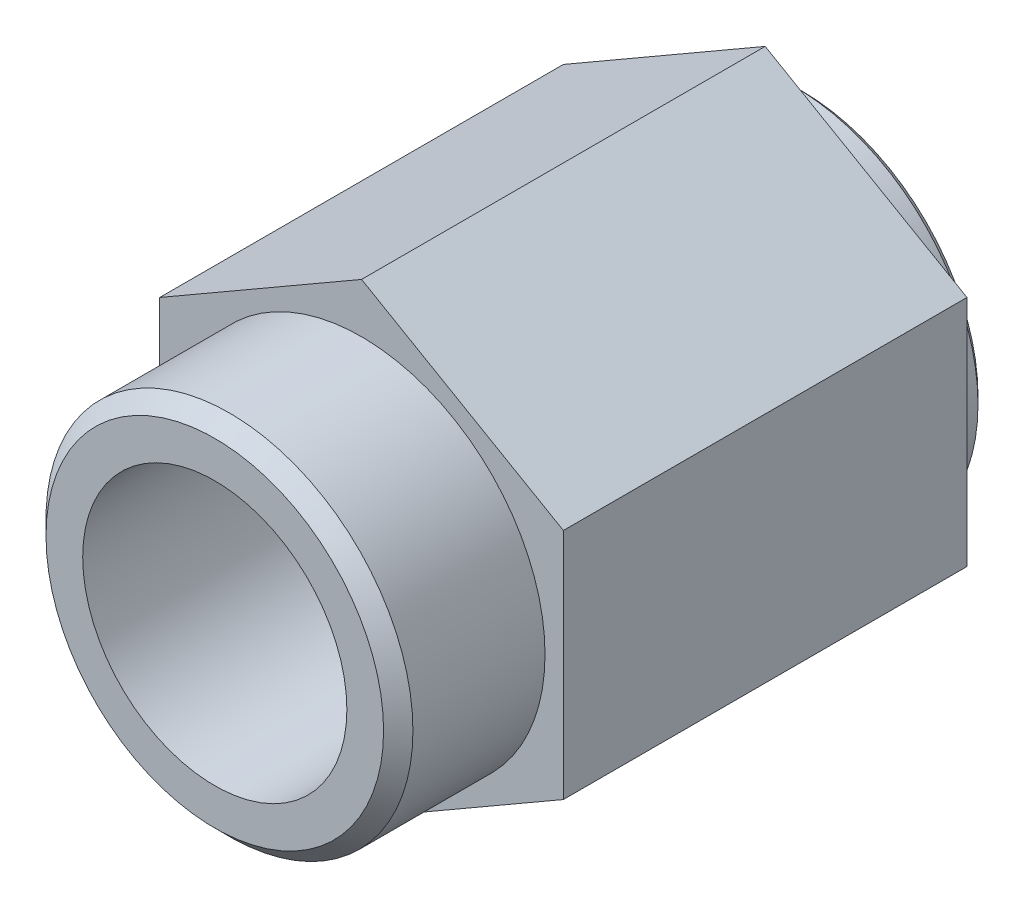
from build123d import *

# Parameters (mm, degrees)
EXTRUDE_1_DEPTH     = 55
SKETCH_2_R          = 25
EXTRUDE_2_DEPTH     = 20
EXTRUDE_START       = 5
SKETCH_3_R          = 25
EXTRUDE_3_DEPTH     = 5
SKETCH_4_R          = 10
CUT_EXTRUDE_1_DEPTH = 40
SKETCH_5_R          = 18
CUT_EXTRUDE_2_DEPTH = 40
CHAMFER_1_SIZE      = 2
CHAMFER_3_SIZE      = 1


with BuildPart() as part:
    # Sketch 1 → Extrude 1 (new body)
    with BuildSketch(Plane.XY):
        Polygon((0, 31.754264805), (-27.5, 15.877132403), (-27.5, -15.877132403), (0, -31.754264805), (27.5, -15.877132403), (27.5, 15.877132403), align=None)
    extrude(amount=EXTRUDE_1_DEPTH)

    # Sketch 2 → Extrude 2 (add)
    with BuildSketch(Plane.XY.offset(55)):
        Circle(SKETCH_2_R)
    extrude(amount=EXTRUDE_2_DEPTH)

    # Sketch 3 → Extrude 3 (add)
    with BuildSketch(Plane(origin=(0, 0, 0), x_dir=(-1, 0, 0), z_dir=(0, 0, -1)).offset(EXTRUDE_START)):
        with Locations(Location((0, 0, 0), (0, 0, 180))):
            Circle(SKETCH_3_R)
    extrude(amount=-EXTRUDE_3_DEPTH)

    # Sketch 4 → Cut-Extrude 1 (cut)
    with BuildSketch(Plane(origin=(0, 0, -5), x_dir=(-1, 0, 0), z_dir=(0, 0, -1))):
        Circle(SKETCH_4_R)
    extrude(amount=-CUT_EXTRUDE_1_DEPTH, mode=Mode.SUBTRACT)

    # Sketch 5 → Cut-Extrude 2 (cut)
    with BuildSketch(Plane.XY.offset(75)):
        Circle(SKETCH_5_R)
    extrude(amount=-CUT_EXTRUDE_2_DEPTH, mode=Mode.SUBTRACT)

    # Chamfer 1
    chamfer_1_edges = [part.edges().sort_by_distance(p)[0] for p in [
        (-25, 0, 75),
    ]]
    chamfer(chamfer_1_edges, length=CHAMFER_1_SIZE)

    # Chamfer 3
    chamfer_3_edges = [part.edges().sort_by_distance(p)[0] for p in [
        (-25, 0, -5),
    ]]
    chamfer(chamfer_3_edges, length=CHAMFER_3_SIZE)


solid = part.part
